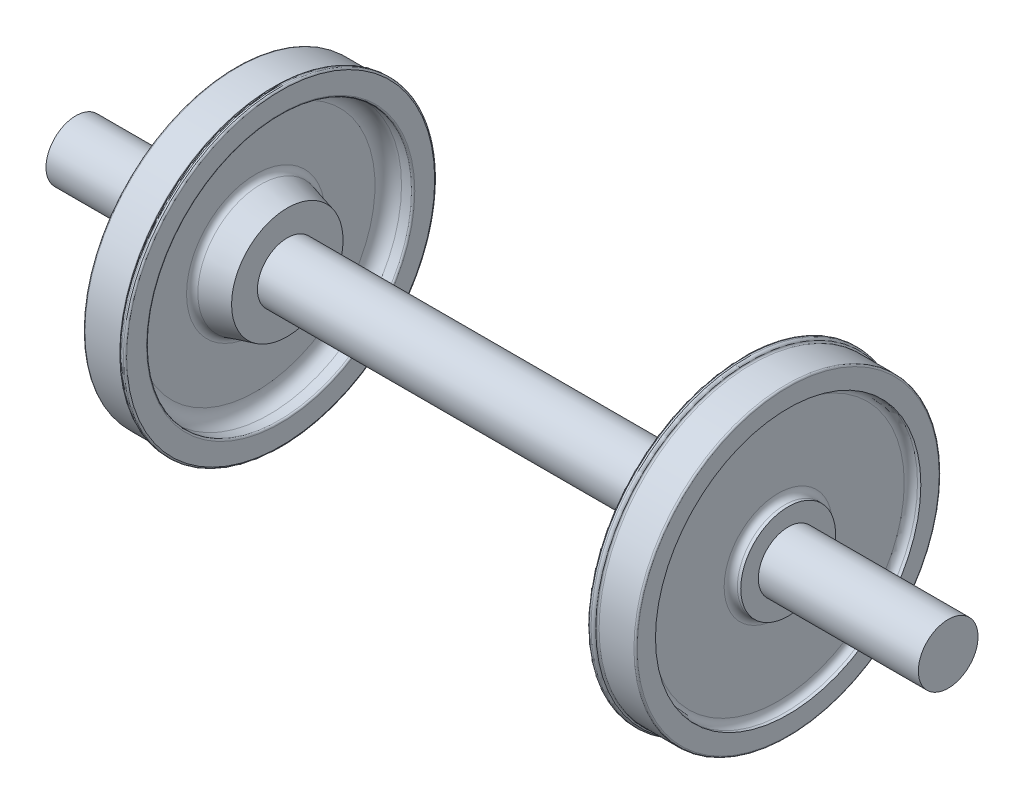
from build123d import *


with BuildPart() as part:
    # Esquisse1 → R_volution1 (revolve)
    with BuildSketch(Plane.XY, mode=Mode.PRIVATE) as r_volution1_sk:
        with BuildLine():
            Line((-677.5, 90), (677.5, 90))
            Line((677.5, 90), (677.5, 168))
            Line((677.5, 168), (757.676380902, 189.483196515))
            ThreePointArc((757.676380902, 189.483196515), (768.367066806, 196.62648446), (772.5, 208.801713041))
            Line((772.5, 208.801713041), (772.5, 359.378670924))
            ThreePointArc((772.5, 359.378670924), (760.784271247, 387.662942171), (732.5, 399.378670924))
            Line((732.5, 399.378670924), (702.5, 399.378670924))
            ThreePointArc((702.5, 399.378670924), (698.964466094, 400.843137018), (697.5, 404.378670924))
            Line((697.5, 404.378670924), (697.5, 464.378670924))
            ThreePointArc((697.5, 464.378670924), (698.964466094, 467.91420483), (702.5, 469.378670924))
            Line((702.5, 469.378670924), (707.5, 469.378670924))
            ThreePointArc((707.5, 469.378670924), (714.571067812, 466.449738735), (717.5, 459.378670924))
            Line((717.5, 459.378670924), (717.5, 465))
            ThreePointArc((717.5, 465), (718.964466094, 461.464466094), (722.5, 460))
            Line((722.5, 460), (827.5, 460))
            ThreePointArc((827.5, 460), (831.035533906, 458.535533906), (832.5, 455))
            Line((832.5, 455), (832.5, 400))
            Line((832.5, 400), (822.5, 400))
            ThreePointArc((822.5, 400), (808.357864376, 394.142135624), (802.5, 380))
            Line((802.5, 380), (802.5, 163))
            ThreePointArc((802.5, 163), (808.357864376, 148.857864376), (822.5, 143))
            Line((822.5, 143), (832.5, 143))
            Line((832.5, 143), (832.5, 90))
            Line((832.5, 90), (1315, 90))
            Line((1315, 90), (1315, 0))
            Line((1315, 0), (-1315, 0))
            Line((-1315, 0), (-1315, 90))
            Line((-1315, 90), (-832.5, 90))
            Line((-832.5, 90), (-832.5, 143))
            Line((-832.5, 143), (-822.5, 143))
            ThreePointArc((-822.5, 143), (-808.357864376, 148.857864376), (-802.5, 163))
            Line((-802.5, 163), (-802.5, 380))
            ThreePointArc((-802.5, 380), (-808.357864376, 394.142135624), (-822.5, 400))
            Line((-822.5, 400), (-832.5, 400))
            Line((-832.5, 400), (-832.5, 455))
            ThreePointArc((-832.5, 455), (-831.035533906, 458.535533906), (-827.5, 460))
            Line((-827.5, 460), (-722.5, 460))
            ThreePointArc((-722.5, 460), (-718.964466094, 461.464466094), (-717.5, 465))
            Line((-717.5, 465), (-717.5, 459.378670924))
            ThreePointArc((-717.5, 459.378670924), (-714.571067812, 466.449738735), (-707.5, 469.378670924))
            Line((-707.5, 469.378670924), (-702.5, 469.378670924))
            ThreePointArc((-702.5, 469.378670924), (-698.964466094, 467.91420483), (-697.5, 464.378670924))
            Line((-697.5, 464.378670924), (-697.5, 404.378670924))
            ThreePointArc((-697.5, 404.378670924), (-698.964466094, 400.843137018), (-702.5, 399.378670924))
            Line((-702.5, 399.378670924), (-732.5, 399.378670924))
            ThreePointArc((-732.5, 399.378670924), (-760.784271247, 387.662942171), (-772.5, 359.378670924))
            Line((-772.5, 359.378670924), (-772.5, 208.801713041))
            ThreePointArc((-772.5, 208.801713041), (-768.367066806, 196.62648446), (-757.676380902, 189.483196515))
            Line((-757.676380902, 189.483196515), (-677.5, 168))
            Line((-677.5, 168), (-677.5, 90))
        make_face()
    revolve(r_volution1_sk.sketch.rotate(Axis((0, 0, 0), (1, 0, 0)), 90), axis=Axis((0, 0, 0), (1, 0, 0)))


solid = part.part
